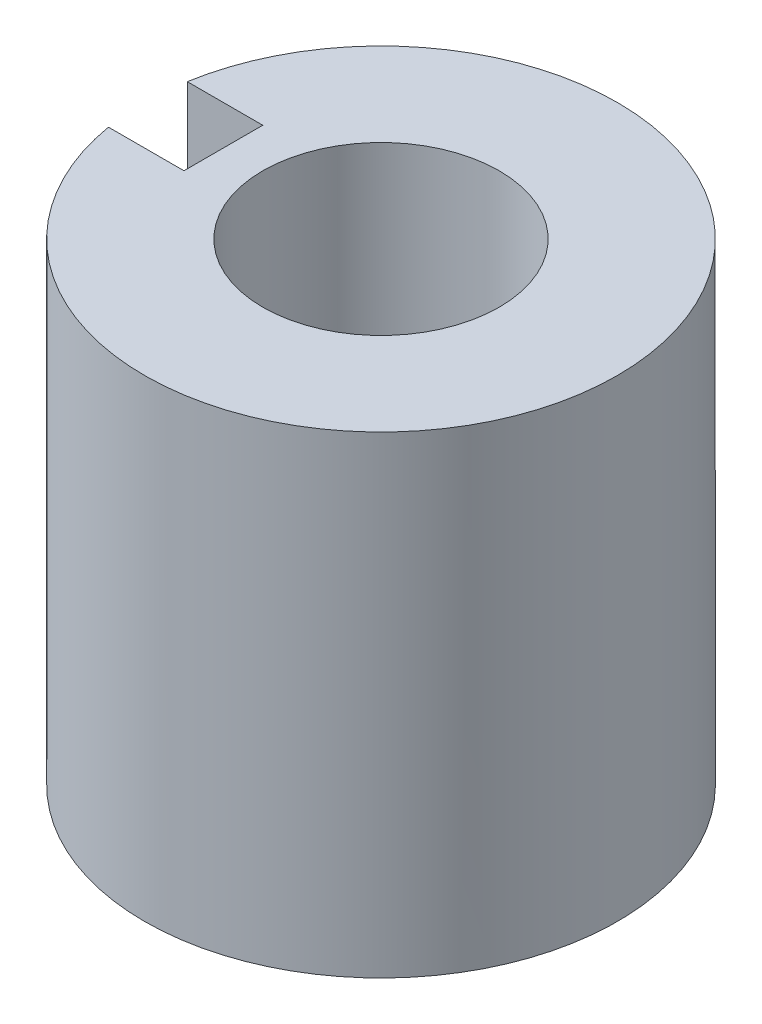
from build123d import *

# Parameters (mm, degrees)
SKETCH1_R           = 3
SKETCH1_R_2         = 1
BOSS_EXTRUDE1_DEPTH = 6
SKETCH3_W           = 1
SKETCH3_H           = 4.5
CUT_EXTRUDE2_DEPTH  = 1
SKETCH4_R           = 1.5
CUT_EXTRUDE4_DEPTH  = 6


with BuildPart() as part:
    # Sketch1 → Boss-Extrude1 (new body)
    with BuildSketch(Plane(origin=(0, 0, 0), x_dir=(1, 0, 0), z_dir=(0, 1, 0))):
        with Locations(Location((3, 0, 0), (0, 0, 270))):
            Circle(SKETCH1_R)
        with Locations(Location((3, 0, 0), (0, 0, 270))):
            Circle(SKETCH1_R_2, mode=Mode.SUBTRACT)
    extrude(amount=BOSS_EXTRUDE1_DEPTH)

    # Sketch3 → Cut-Extrude2 (cut)
    with BuildSketch(Plane(origin=(0, 0, 0), x_dir=(0, 0, -1), z_dir=(1, 0, 0))):
        with Locations((0, 3.75)):
            Rectangle(SKETCH3_W, SKETCH3_H)
    extrude(amount=CUT_EXTRUDE2_DEPTH, mode=Mode.SUBTRACT)

    # Sketch4 → Cut-Extrude4 (cut)
    with BuildSketch(Plane(origin=(0, 6, 0), x_dir=(1, 0, 0), z_dir=(0, 1, 0))):
        with Locations(Location((3, 0, 0), (0, 0, 270))):
            Circle(SKETCH4_R)
    extrude(amount=-CUT_EXTRUDE4_DEPTH, mode=Mode.SUBTRACT)


solid = part.part
